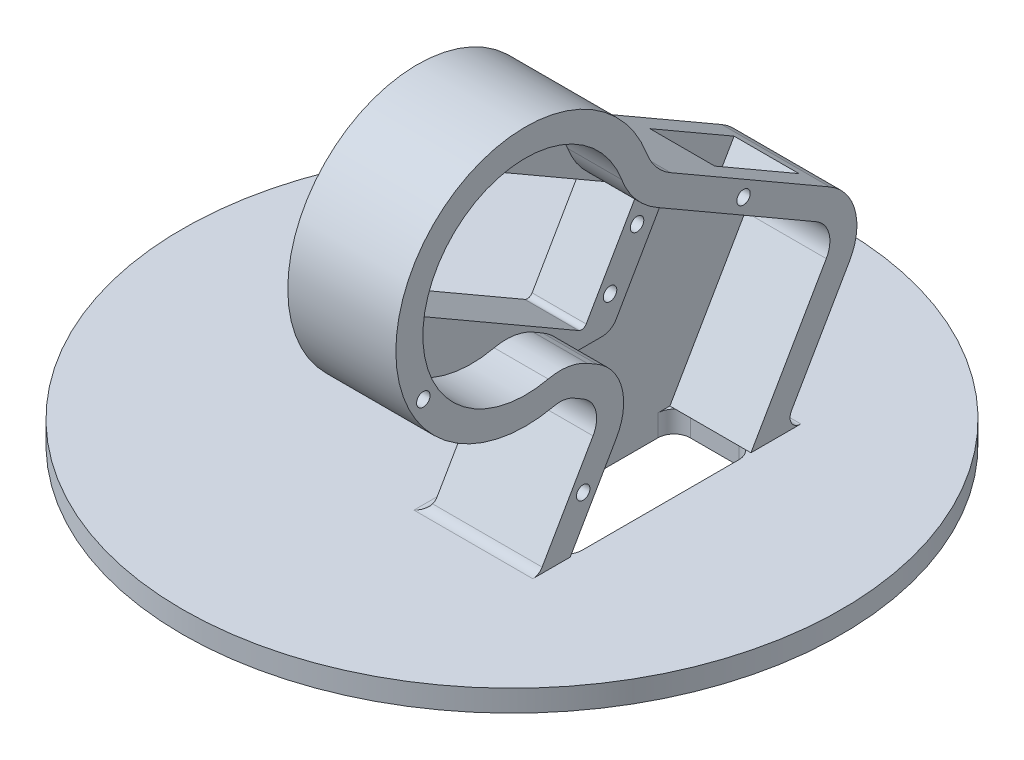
from build123d import *

# Parameters (mm, degrees)
SKETCH1_R               = 61
BOSS_EXTRUDE1_DEPTH     = 4
SKETCH2_R               = 11
CUT_EXTRUDE1_DEPTH      = 2
SKETCH2_3_W             = 15
SKETCH2_3_H             = 35
CUT_EXTRUDE2_DEPTH      = 87.35971283
FILLET1_R               = 3
M3_TAPPED_HOLE1_D       = 2.5
BOSS_EXTRUDE3_START     = 5
BOSS_EXTRUDE3_DEPTH     = 20
SHELL4_T                = -5
BOSS_EXTRUDE4_DEPTH     = 5
CUT_EXTRUDE4_DEPTH      = 118.298915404
CUT_EXTRUDE4_DEPTH_BACK = 118.298915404
M3_TAPPED_HOLE2_D       = 2.5
M3_TAPPED_HOLE2_DEPTH   = 7.5
M3_TAPPED_HOLE2_TIP     = 0.751075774
FILLET2_R               = 2
FILLET3_R               = 1
M3_TAPPED_HOLE3_D       = 2.5
M3_TAPPED_HOLE3_DEPTH   = 7.5
M3_TAPPED_HOLE3_TIP     = 0.751075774
CUT_EXTRUDE8_DEPTH      = 5
CUT_EXTRUDE5_START      = -5
SKETCH18_W              = 12
SKETCH18_H              = 18
CUT_EXTRUDE5_DEPTH      = 5
FILLET4_R               = 3


with BuildPart() as part:
    # Sketch1 → Boss-Extrude1 (new body)
    with BuildSketch(Plane(origin=(0, 0, 0), x_dir=(1, 0, 0), z_dir=(0, 1, 0))):
        with Locations(Location((0, 0, 0), (0, 0, 270))):
            Circle(SKETCH1_R)
    extrude(amount=-BOSS_EXTRUDE1_DEPTH)

    # Sketch2 → Cut-Extrude1 (cut)
    with BuildSketch(Plane.XZ.offset(4)):
        with Locations(Location((0, 0, 0), (0, 0, 270))):
            Circle(SKETCH2_R)
    extrude(amount=-CUT_EXTRUDE1_DEPTH, mode=Mode.SUBTRACT)

    # Sketch2_3 → Cut-Extrude2 (cut, through all)
    with BuildSketch(Plane.XZ.offset(4)):
        with Locations((20, 0)):
            Rectangle(SKETCH2_3_W, SKETCH2_3_H)
    extrude(amount=-CUT_EXTRUDE2_DEPTH, mode=Mode.SUBTRACT)

    # Fillet1
    fillet1_edges = [part.edges().sort_by_distance(p)[0] for p in [
        (12.5, -2, -17.5),
        (12.5, -2, 17.5),
        (27.5, -2, 17.5),
        (27.5, -2, -17.5),
    ]]
    fillet(fillet1_edges, radius=FILLET1_R)

    # M3 Tapped Hole1 (through all)
    with Locations(Plane(origin=(0, -2, 0), x_dir=(-1, 0, 0), z_dir=(0, -1, 0))):
        with Locations((0, -7), (0, 7), (0, 0)):
            Hole(M3_TAPPED_HOLE1_D / 2)


with BuildPart() as body_2:
    # Sketch7 → Boss-Extrude3 (new body)
    with BuildSketch(Plane.ZY.offset(-12.5).offset(BOSS_EXTRUDE3_START)):
        with BuildLine():
            Line((-22.5, 0), (22.5, 0))
            Line((22.5, 0), (12.5, 17.320508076))
            ThreePointArc((12.5, 17.320508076), (12.000497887, 21.114603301), (14.330127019, 24.150635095))
            Line((14.330127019, 24.150635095), (16.08452071, 25.163534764))
            ThreePointArc((16.08452071, 25.163534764), (17.83602001, 25.777064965), (19.690637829, 25.709523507))
            ThreePointArc((19.690637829, 25.709523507), (46.11435696, 60.524696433), (2.512120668, 57.499107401))
            ThreePointArc((2.512120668, 57.499107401), (0.777476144, 54.534818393), (-1.857829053, 52.332281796))
            Line((-1.857829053, 52.332281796), (-31.339745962, 35.310889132))
            ThreePointArc((-31.339745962, 35.310889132), (-35.999004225, 29.238825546), (-35, 21.650635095))
            Line((-35, 21.650635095), (-22.5, 0))
        make_face()
    extrude(amount=-BOSS_EXTRUDE3_DEPTH)

    # Shell4
    shell4_openings = [body_2.faces().sort_by_distance(p)[0] for p in [
        (27.5, 34.907631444, 7.675121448),
        (17.5, 0, 0),
    ]]
    offset(amount=SHELL4_T, openings=shell4_openings, kind=Kind.INTERSECTION)

    # Combine1: union part
    add(part.part)

    # Sketch9 → Boss-Extrude4 (add)
    with BuildSketch(Plane(origin=(12.5, 0, 0), x_dir=(0, 0, -1), z_dir=(1, 0, 0))):
        with BuildLine():
            Line((-0.642170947, 48.002154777), (28.839745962, 30.980762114))
            ThreePointArc((28.839745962, 30.980762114), (31.169375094, 27.94473032), (30.669872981, 24.150635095))
            Line((30.669872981, 24.150635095), (25.283121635, 14.820508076))
            Line((25.283121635, 14.820508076), (-8.169872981, 14.820508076))
            ThreePointArc((-8.169872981, 14.820508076), (-7.170868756, 22.408698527), (-11.830127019, 28.480762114))
            Line((-11.830127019, 28.480762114), (-13.58452071, 29.493661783))
            ThreePointArc((-13.58452071, 29.493661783), (-17.087519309, 30.720722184), (-20.796754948, 30.585639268))
            ThreePointArc((-20.796754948, 30.585639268), (-41.715532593, 58.147651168), (-7.197095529, 55.752393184))
            ThreePointArc((-7.197095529, 55.752393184), (-4.595128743, 51.305959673), (-0.642170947, 48.002154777))
        make_face()
    extrude(amount=BOSS_EXTRUDE4_DEPTH)

    # Sketch8 → Cut-Extrude4 (cut, two sides: drawn at the far end of the back side and taken through both)
    with BuildSketch(Plane.ZY.offset(-7.5).offset(-CUT_EXTRUDE4_DEPTH_BACK)):
        Polygon((40.642304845, 46.021612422), (30.142304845, 64.208145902), (-6.230762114, 43.208145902), (4.269237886, 25.021612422), align=None)
    extrude(amount=CUT_EXTRUDE4_DEPTH + CUT_EXTRUDE4_DEPTH_BACK, mode=Mode.SUBTRACT)

    # M3 Tapped Hole2
    with Locations(Plane(origin=(17.5, 0, 0), x_dir=(0, 0, -1), z_dir=(1, 0, 0))):
        with Locations((-35.057368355, 60.695006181), (-40.057368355, 52.034752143), (5.645825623, 37.195006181), (0.645825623, 28.534752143)):
            Hole(M3_TAPPED_HOLE2_D / 2, depth=M3_TAPPED_HOLE2_DEPTH)
            with Locations((0, 0, -(M3_TAPPED_HOLE2_DEPTH + M3_TAPPED_HOLE2_TIP / 2))):  # 118° drill point
                Cone(0, M3_TAPPED_HOLE2_D / 2, M3_TAPPED_HOLE2_TIP, mode=Mode.SUBTRACT)

    # Fillet2
    fillet2_edges = [body_2.edges().sort_by_distance(p)[0] for p in [
        (7.5, 0, 0),
        (17.5, 0, 22.5),
        (17.5, 0, -22.5),
    ]]
    fillet(fillet2_edges, radius=FILLET2_R)

    # Fillet3
    fillet3_edges = [body_2.edges().sort_by_distance(p)[0] for p in [
        (12.5, 64.208145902, 30.142304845),
        (12.5, 46.021612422, 40.642304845),
        (12.5, 25.021612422, 4.269237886),
        (12.5, 43.208145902, -6.230762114),
    ]]
    fillet(fillet3_edges, radius=FILLET3_R)

    # M3 Tapped Hole3
    with Locations(Plane(origin=(27.5, 0, 0), x_dir=(0, 0, -1), z_dir=(1, 0, 0))):
        with Locations((-43.914944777, 38.893584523), (-14.324573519, 9.160254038), (15.348787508, 41.656521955)):
            Hole(M3_TAPPED_HOLE3_D / 2, depth=M3_TAPPED_HOLE3_DEPTH)
            with Locations((0, 0, -(M3_TAPPED_HOLE3_DEPTH + M3_TAPPED_HOLE3_TIP / 2))):  # 118° drill point
                Cone(0, M3_TAPPED_HOLE3_D / 2, M3_TAPPED_HOLE3_TIP, mode=Mode.SUBTRACT)

    # Sketch20 → Cut-Extrude8 (cut)
    with BuildSketch(Plane(origin=(17.5, 0, 0), x_dir=(0, 0, -1), z_dir=(1, 0, 0))):
        with BuildLine():
            Line((25.283121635, 14.820508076), (-8.169872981, 14.820508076))
            ThreePointArc((-8.169872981, 14.820508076), (-6.915678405, 18.515246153), (-7.170868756, 22.408698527))
            Line((-7.170868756, 22.408698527), (0.92862497, 22.408698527))
            Line((0.92862497, 22.408698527), (11.618217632, 40.923616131))
            Line((11.618217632, 40.923616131), (28.839745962, 30.980762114))
            ThreePointArc((28.839745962, 30.980762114), (31.169375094, 27.94473032), (30.669872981, 24.150635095))
            Line((30.669872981, 24.150635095), (25.283121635, 14.820508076))
        make_face()
    extrude(amount=-CUT_EXTRUDE8_DEPTH, mode=Mode.SUBTRACT)

    # Sketch18 → Cut-Extrude5 (cut)
    with BuildSketch(Plane(origin=(0, 40.053674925, -23.125), x_dir=(1, 0, 0), z_dir=(0, 0.8660254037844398, -0.4999999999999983)).offset(CUT_EXTRUDE5_START)):
        with Locations((17.5, -1.514428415)):
            Rectangle(SKETCH18_W, SKETCH18_H)
    extrude(amount=CUT_EXTRUDE5_DEPTH, mode=Mode.SUBTRACT)

    # Fillet4
    fillet4_edges = [body_2.edges().sort_by_distance(p)[0] for p in [
        (15, 22.408698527, -0.92862497),
    ]]
    fillet(fillet4_edges, radius=FILLET4_R)


solid = body_2.part
